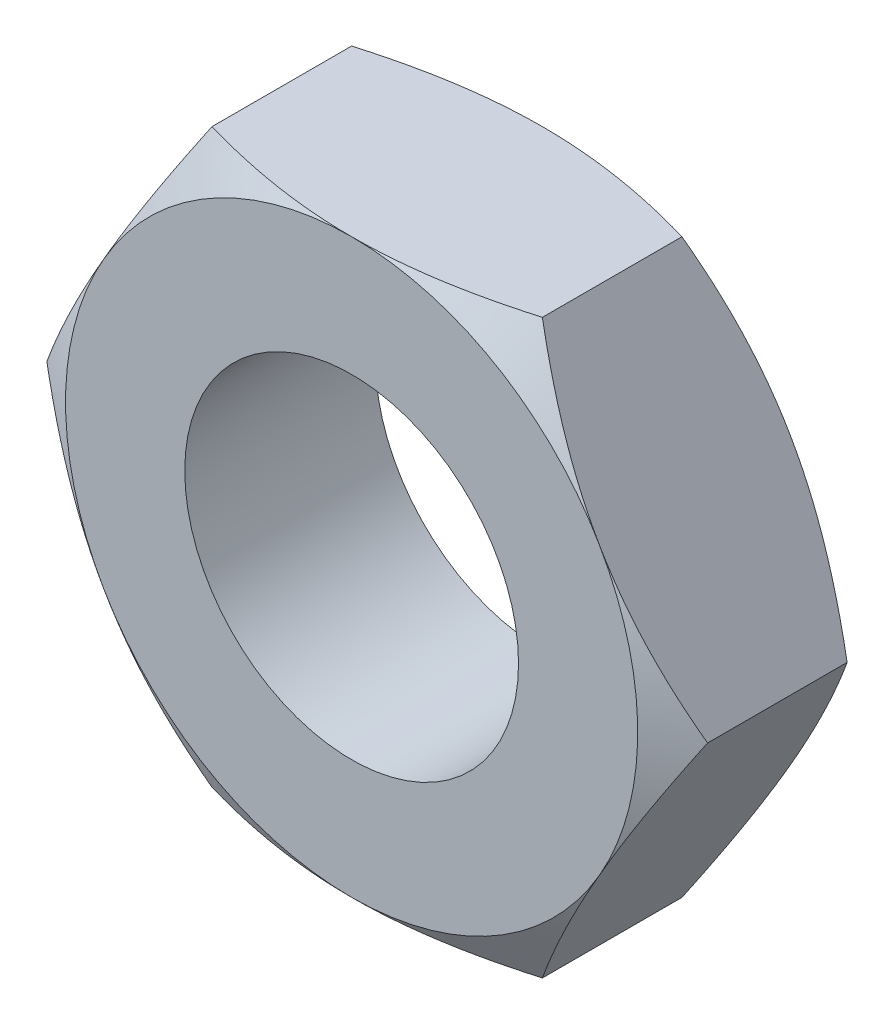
ISO-10303-21;
HEADER;
FILE_DESCRIPTION(('STEP AP214'),'2;1');
FILE_NAME('part.step','',(''),(''),'','','');
FILE_SCHEMA(('AUTOMOTIVE_DESIGN { 1 0 10303 214 1 1 1 1 }'));
ENDSEC;
DATA;
#1=APPLICATION_CONTEXT('core data for automotive mechanical design processes');
#2=APPLICATION_PROTOCOL_DEFINITION('international standard','automotive_design',2000,#1);
#3=PRODUCT_CONTEXT('',#1,'mechanical');
#4=PRODUCT('Part','Part','',(#3));
#5=PRODUCT_RELATED_PRODUCT_CATEGORY('part','',(#4));
#6=PRODUCT_DEFINITION_FORMATION('','',#4);
#7=PRODUCT_DEFINITION_CONTEXT('part definition',#1,'design');
#8=PRODUCT_DEFINITION('design','',#6,#7);
#9=PRODUCT_DEFINITION_SHAPE('','',#8);
#10=(LENGTH_UNIT() NAMED_UNIT(*) SI_UNIT(.MILLI.,.METRE.));
#11=(NAMED_UNIT(*) PLANE_ANGLE_UNIT() SI_UNIT($,.RADIAN.));
#12=(NAMED_UNIT(*) SI_UNIT($,.STERADIAN.) SOLID_ANGLE_UNIT());
#13=UNCERTAINTY_MEASURE_WITH_UNIT(LENGTH_MEASURE(1.E-05),#10,'distance_accuracy_value','');
#14=(GEOMETRIC_REPRESENTATION_CONTEXT(3) GLOBAL_UNCERTAINTY_ASSIGNED_CONTEXT((#13)) GLOBAL_UNIT_ASSIGNED_CONTEXT((#10,
#11,#12)) REPRESENTATION_CONTEXT('',''));
#15=CARTESIAN_POINT('',(0.,0.,0.));
#16=DIRECTION('',(0.,0.,1.));
#17=DIRECTION('',(1.,0.,0.));
#18=AXIS2_PLACEMENT_3D('',#15,#16,#17);
#19=CARTESIAN_POINT('',(-8.66025403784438,-15.,10.));
#20=DIRECTION('',(0.,1.,0.));
#21=DIRECTION('',(0.,0.,1.));
#22=AXIS2_PLACEMENT_3D('',#19,#20,#21);
#23=PLANE('',#22);
#24=DIRECTION('',(0.,0.,-1.));
#25=VECTOR('',#24,1.);
#26=CARTESIAN_POINT('',(-8.66025403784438,-15.,10.));
#27=LINE('',#26,#25);
#28=CARTESIAN_POINT('',(-8.66025403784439,-15.,8.66025403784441));
#29=VERTEX_POINT('',#28);
#30=CARTESIAN_POINT('',(-8.66025403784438,-15.,1.33974596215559));
#31=VERTEX_POINT('',#30);
#32=EDGE_CURVE('E257',#29,#31,#27,.T.);
#33=ORIENTED_EDGE('',*,*,#32,.T.);
#34=CARTESIAN_POINT('',(-22.9682699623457,-15.,7.17790057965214));
#35=CARTESIAN_POINT('',(-22.6389897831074,-15.,7.0187314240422));
#36=CARTESIAN_POINT('',(-22.3093116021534,-15.,6.86038603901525));
#37=CARTESIAN_POINT('',(-21.6490751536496,-15.,6.54553189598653));
#38=CARTESIAN_POINT('',(-21.3185168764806,-15.,6.38902315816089));
#39=CARTESIAN_POINT('',(-20.3252989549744,-15.,5.92249019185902));
#40=CARTESIAN_POINT('',(-19.6612032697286,-15.,5.6155111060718));
#41=CARTESIAN_POINT('',(-18.3246226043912,-15.,5.00989859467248));
#42=CARTESIAN_POINT('',(-17.6521113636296,-15.,4.71132298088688));
#43=CARTESIAN_POINT('',(-16.3015621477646,-15.,4.12699119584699));
#44=CARTESIAN_POINT('',(-15.6235244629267,-15.,3.84123435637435));
#45=CARTESIAN_POINT('',(-14.2524269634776,-15.,3.28256457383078));
#46=CARTESIAN_POINT('',(-13.5592849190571,-15.,3.00985238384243));
#47=CARTESIAN_POINT('',(-12.1648203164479,-15.,2.48578579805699));
#48=CARTESIAN_POINT('',(-11.4634968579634,-15.,2.23443377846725));
#49=CARTESIAN_POINT('',(-10.0530172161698,-15.,1.75984469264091));
#50=CARTESIAN_POINT('',(-9.34388131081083,-15.,1.53654785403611));
#51=CARTESIAN_POINT('',(-7.91545988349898,-15.,1.12531011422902));
#52=CARTESIAN_POINT('',(-7.19617764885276,-15.,0.937358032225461));
#53=CARTESIAN_POINT('',(-6.10950776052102,-15.,0.688818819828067));
#54=CARTESIAN_POINT('',(-5.74591626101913,-15.,0.61152452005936));
#55=CARTESIAN_POINT('',(-5.01631310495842,-15.,0.469286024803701));
#56=CARTESIAN_POINT('',(-4.65030150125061,-15.,0.404341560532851));
#57=CARTESIAN_POINT('',(-3.91609659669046,-15.,0.287952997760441));
#58=CARTESIAN_POINT('',(-3.5479031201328,-15.,0.236510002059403));
#59=CARTESIAN_POINT('',(-2.80977894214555,-15.,0.148161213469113));
#60=CARTESIAN_POINT('',(-2.43984831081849,-15.,0.111254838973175));
#61=CARTESIAN_POINT('',(-1.70111543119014,-15.,0.05296923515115));
#62=CARTESIAN_POINT('',(-1.3323208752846,-15.,0.0314931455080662));
#63=CARTESIAN_POINT('',(-0.59415403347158,-15.,0.00418216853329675));
#64=CARTESIAN_POINT('',(-0.224781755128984,-15.,-0.0016529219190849));
#65=CARTESIAN_POINT('',(0.513772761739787,-15.,0.00245653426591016));
#66=CARTESIAN_POINT('',(0.882955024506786,-15.,0.0123966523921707));
#67=CARTESIAN_POINT('',(1.62057875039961,-15.,0.047809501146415));
#68=CARTESIAN_POINT('',(1.98902017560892,-15.,0.0732830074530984));
#69=CARTESIAN_POINT('',(2.88200878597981,-15.,0.153315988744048));
#70=CARTESIAN_POINT('',(3.40586988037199,-15.,0.215658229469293));
#71=CARTESIAN_POINT('',(4.44957771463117,-15.,0.368284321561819));
#72=CARTESIAN_POINT('',(4.96942331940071,-15.,0.458575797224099));
#73=CARTESIAN_POINT('',(6.00467140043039,-15.,0.663898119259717));
#74=CARTESIAN_POINT('',(6.52006919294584,-15.,0.778952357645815));
#75=CARTESIAN_POINT('',(7.54556200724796,-15.,1.03028935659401));
#76=CARTESIAN_POINT('',(8.05565752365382,-15.,1.16657011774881));
#77=CARTESIAN_POINT('',(9.08310964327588,-15.,1.46066370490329));
#78=CARTESIAN_POINT('',(9.60033774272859,-15.,1.61892244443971));
#79=CARTESIAN_POINT('',(10.6293258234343,-15.,1.95107200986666));
#80=CARTESIAN_POINT('',(11.1410893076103,-15.,2.12495205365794));
#81=CARTESIAN_POINT('',(12.157099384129,-15.,2.48477464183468));
#82=CARTESIAN_POINT('',(12.6613720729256,-15.,2.67064378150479));
#83=CARTESIAN_POINT('',(13.4147912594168,-15.,2.95756327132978));
#84=CARTESIAN_POINT('',(13.6654863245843,-15.,3.05457748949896));
#85=CARTESIAN_POINT('',(14.1659013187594,-15.,3.25107322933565));
#86=CARTESIAN_POINT('',(14.4156212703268,-15.,3.35055469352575));
#87=CARTESIAN_POINT('',(14.6648887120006,-15.,3.45115877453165));
#88=B_SPLINE_CURVE_WITH_KNOTS('',3,(#34,#35,#36,#37,#38,#39,#40,#41,#42,#43,#44,#45,#46,#47,#48,
#49,#50,#51,#52,#53,#54,#55,#56,#57,#58,#59,#60,#61,#62,#63,#64,#65,#66,#67,#68,#69,#70,#71,#72,
#73,#74,#75,#76,#77,#78,#79,#80,#81,#82,#83,#84,#85,#86,#87),.UNSPECIFIED.,.F.,.F.,(4,2,2,2,2,2,
2,2,2,2,2,2,2,2,2,2,2,2,2,2,2,2,2,2,2,2,4),(0.,1.09719534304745,2.19440272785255,
4.38917437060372,6.59650580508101,8.80372204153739,11.0380360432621,13.2725982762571,
15.5023159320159,17.7313270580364,18.8463006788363,19.9612500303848,21.0762904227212,
22.1912861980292,23.2992201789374,24.407139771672,25.5147483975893,26.6224123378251,
28.2042036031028,29.7864267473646,31.3701511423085,32.9537264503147,34.5761185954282,
36.1973994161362,37.8095545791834,38.6159794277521,39.4223855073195),.UNSPECIFIED.);
#89=CARTESIAN_POINT('',(0.,-15.,0.));
#90=VERTEX_POINT('',#89);
#91=EDGE_CURVE('E60',#31,#90,#88,.T.);
#92=ORIENTED_EDGE('',*,*,#91,.T.);
#93=CARTESIAN_POINT('',(8.66025403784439,-15.,1.33974596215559));
#94=VERTEX_POINT('',#93);
#95=EDGE_CURVE('E213',#90,#94,#88,.T.);
#96=ORIENTED_EDGE('',*,*,#95,.T.);
#97=DIRECTION('',(0.,0.,-1.));
#98=VECTOR('',#97,1.);
#99=CARTESIAN_POINT('',(8.66025403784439,-15.,10.));
#100=LINE('',#99,#98);
#101=CARTESIAN_POINT('',(8.66025403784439,-15.,8.66025403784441));
#102=VERTEX_POINT('',#101);
#103=EDGE_CURVE('E274',#102,#94,#100,.T.);
#104=ORIENTED_EDGE('',*,*,#103,.F.);
#105=CARTESIAN_POINT('',(-22.9682699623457,-15.,2.82209942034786));
#106=CARTESIAN_POINT('',(-22.6389897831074,-15.,2.9812685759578));
#107=CARTESIAN_POINT('',(-22.3093116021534,-15.,3.13961396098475));
#108=CARTESIAN_POINT('',(-21.6490751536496,-15.,3.45446810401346));
#109=CARTESIAN_POINT('',(-21.3185168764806,-15.,3.61097684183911));
#110=CARTESIAN_POINT('',(-20.3252989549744,-15.,4.07750980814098));
#111=CARTESIAN_POINT('',(-19.6612032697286,-15.,4.3844888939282));
#112=CARTESIAN_POINT('',(-18.3246226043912,-15.,4.99010140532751));
#113=CARTESIAN_POINT('',(-17.6521113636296,-15.,5.28867701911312));
#114=CARTESIAN_POINT('',(-16.3015621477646,-15.,5.87300880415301));
#115=CARTESIAN_POINT('',(-15.6235244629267,-15.,6.15876564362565));
#116=CARTESIAN_POINT('',(-14.2524269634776,-15.,6.71743542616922));
#117=CARTESIAN_POINT('',(-13.5592849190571,-15.,6.99014761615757));
#118=CARTESIAN_POINT('',(-12.1648203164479,-15.,7.51421420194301));
#119=CARTESIAN_POINT('',(-11.4634968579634,-15.,7.76556622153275));
#120=CARTESIAN_POINT('',(-10.0530172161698,-15.,8.24015530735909));
#121=CARTESIAN_POINT('',(-9.34388131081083,-15.,8.46345214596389));
#122=CARTESIAN_POINT('',(-7.91545988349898,-15.,8.87468988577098));
#123=CARTESIAN_POINT('',(-7.19617764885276,-15.,9.06264196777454));
#124=CARTESIAN_POINT('',(-6.10950776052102,-15.,9.31118118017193));
#125=CARTESIAN_POINT('',(-5.74591626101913,-15.,9.38847547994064));
#126=CARTESIAN_POINT('',(-5.01631310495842,-15.,9.5307139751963));
#127=CARTESIAN_POINT('',(-4.65030150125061,-15.,9.59565843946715));
#128=CARTESIAN_POINT('',(-3.91609659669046,-15.,9.71204700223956));
#129=CARTESIAN_POINT('',(-3.5479031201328,-15.,9.7634899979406));
#130=CARTESIAN_POINT('',(-2.80977894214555,-15.,9.85183878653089));
#131=CARTESIAN_POINT('',(-2.43984831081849,-15.,9.88874516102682));
#132=CARTESIAN_POINT('',(-1.70111543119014,-15.,9.94703076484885));
#133=CARTESIAN_POINT('',(-1.3323208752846,-15.,9.96850685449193));
#134=CARTESIAN_POINT('',(-0.594154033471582,-15.,9.9958178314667));
#135=CARTESIAN_POINT('',(-0.224781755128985,-15.,10.0016529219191));
#136=CARTESIAN_POINT('',(0.513772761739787,-15.,9.99754346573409));
#137=CARTESIAN_POINT('',(0.882955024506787,-15.,9.98760334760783));
#138=CARTESIAN_POINT('',(1.62057875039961,-15.,9.95219049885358));
#139=CARTESIAN_POINT('',(1.98902017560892,-15.,9.9267169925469));
#140=CARTESIAN_POINT('',(2.88200878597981,-15.,9.84668401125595));
#141=CARTESIAN_POINT('',(3.40586988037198,-15.,9.78434177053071));
#142=CARTESIAN_POINT('',(4.44957771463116,-15.,9.63171567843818));
#143=CARTESIAN_POINT('',(4.9694233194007,-15.,9.5414242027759));
#144=CARTESIAN_POINT('',(6.00467140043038,-15.,9.33610188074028));
#145=CARTESIAN_POINT('',(6.52006919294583,-15.,9.22104764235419));
#146=CARTESIAN_POINT('',(7.54556200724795,-15.,8.96971064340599));
#147=CARTESIAN_POINT('',(8.05565752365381,-15.,8.83342988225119));
#148=CARTESIAN_POINT('',(9.08310964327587,-15.,8.53933629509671));
#149=CARTESIAN_POINT('',(9.60033774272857,-15.,8.3810775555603));
#150=CARTESIAN_POINT('',(10.6293258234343,-15.,8.04892799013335));
#151=CARTESIAN_POINT('',(11.1410893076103,-15.,7.87504794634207));
#152=CARTESIAN_POINT('',(12.157099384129,-15.,7.51522535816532));
#153=CARTESIAN_POINT('',(12.6613720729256,-15.,7.32935621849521));
#154=CARTESIAN_POINT('',(13.4147912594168,-15.,7.04243672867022));
#155=CARTESIAN_POINT('',(13.6654863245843,-15.,6.94542251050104));
#156=CARTESIAN_POINT('',(14.1659013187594,-15.,6.74892677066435));
#157=CARTESIAN_POINT('',(14.4156212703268,-15.,6.64944530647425));
#158=CARTESIAN_POINT('',(14.6648887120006,-15.,6.54884122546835));
#159=B_SPLINE_CURVE_WITH_KNOTS('',3,(#105,#106,#107,#108,#109,#110,#111,#112,#113,#114,#115,
#116,#117,#118,#119,#120,#121,#122,#123,#124,#125,#126,#127,#128,#129,#130,#131,#132,#133,#134,
#135,#136,#137,#138,#139,#140,#141,#142,#143,#144,#145,#146,#147,#148,#149,#150,#151,#152,#153,
#154,#155,#156,#157,#158),.UNSPECIFIED.,.F.,.F.,(4,2,2,2,2,2,2,2,2,2,2,2,2,2,2,2,2,2,2,2,2,2,2,
2,2,2,4),(0.,1.09719534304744,2.19440272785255,4.38917437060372,6.596505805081,8.80372204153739,
11.0380360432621,13.2725982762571,15.5023159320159,17.7313270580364,18.8463006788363,
19.9612500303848,21.0762904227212,22.1912861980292,23.2992201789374,24.407139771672,
25.5147483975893,26.6224123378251,28.2042036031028,29.7864267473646,31.3701511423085,
32.9537264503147,34.5761185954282,36.1973994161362,37.8095545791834,38.6159794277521,
39.4223855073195),.UNSPECIFIED.);
#160=CARTESIAN_POINT('',(0.,-15.,10.));
#161=VERTEX_POINT('',#160);
#162=EDGE_CURVE('E328',#102,#161,#159,.F.);
#163=ORIENTED_EDGE('',*,*,#162,.T.);
#164=EDGE_CURVE('E321',#161,#29,#159,.F.);
#165=ORIENTED_EDGE('',*,*,#164,.T.);
#166=EDGE_LOOP('',(#33,#92,#96,#104,#163,#165));
#167=FACE_BOUND('',#166,.T.);
#168=ADVANCED_FACE('F37',(#167),#23,.F.);
#169=CARTESIAN_POINT('',(8.66025403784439,-15.,10.));
#170=DIRECTION('',(-0.866025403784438,0.5,0.));
#171=DIRECTION('',(-0.5,-0.866025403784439,0.));
#172=AXIS2_PLACEMENT_3D('',#169,#170,#171);
#173=PLANE('',#172);
#174=ORIENTED_EDGE('',*,*,#103,.T.);
#175=CARTESIAN_POINT('',(8.66013856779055,-15.0002,1.33981262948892));
#176=CARTESIAN_POINT('',(8.85048754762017,-14.6705058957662,1.22992178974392));
#177=CARTESIAN_POINT('',(9.04157899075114,-14.3395258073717,1.1250175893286));
#178=CARTESIAN_POINT('',(9.42529420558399,-13.674911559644,0.926568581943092));
#179=CARTESIAN_POINT('',(9.61791845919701,-13.3412765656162,0.833027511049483));
#180=CARTESIAN_POINT('',(10.0050715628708,-12.6707077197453,0.658562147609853));
#181=CARTESIAN_POINT('',(10.199603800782,-12.333767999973,0.577667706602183));
#182=CARTESIAN_POINT('',(10.5900200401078,-11.6575472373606,0.430232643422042));
#183=CARTESIAN_POINT('',(10.7859039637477,-11.3182663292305,0.363691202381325));
#184=CARTESIAN_POINT('',(11.1740042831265,-10.6460568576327,0.247792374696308));
#185=CARTESIAN_POINT('',(11.3661918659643,-10.3131781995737,0.198051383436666));
#186=CARTESIAN_POINT('',(11.7514476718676,-9.64589556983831,0.114646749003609));
#187=CARTESIAN_POINT('',(11.9445159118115,-9.31149156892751,0.0809834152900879));
#188=CARTESIAN_POINT('',(12.3309767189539,-8.64212181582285,0.0305840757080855));
#189=CARTESIAN_POINT('',(12.5243686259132,-8.30715720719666,0.013827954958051));
#190=CARTESIAN_POINT('',(12.9113309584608,-7.636918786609,-0.00239660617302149));
#191=CARTESIAN_POINT('',(13.1049013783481,-7.30164498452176,-0.0018655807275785));
#192=CARTESIAN_POINT('',(13.4667798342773,-6.6748531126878,0.0152766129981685));
#193=CARTESIAN_POINT('',(13.6351136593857,-6.38329037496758,0.0297968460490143));
#194=CARTESIAN_POINT('',(13.9713941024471,-5.80083556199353,0.0716371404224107));
#195=CARTESIAN_POINT('',(14.1393406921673,-5.50994353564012,0.0989581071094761));
#196=CARTESIAN_POINT('',(14.4747554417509,-4.92898814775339,0.165923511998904));
#197=CARTESIAN_POINT('',(14.6422230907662,-4.63892567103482,0.20557812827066));
#198=CARTESIAN_POINT('',(14.9763732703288,-4.06016058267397,0.296515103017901));
#199=CARTESIAN_POINT('',(15.1430557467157,-3.77145806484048,0.347798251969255));
#200=CARTESIAN_POINT('',(15.6490296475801,-2.8950855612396,0.520386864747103));
#201=CARTESIAN_POINT('',(15.9868558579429,-2.30995340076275,0.658901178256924));
#202=CARTESIAN_POINT('',(16.6574708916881,-1.14841408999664,0.973271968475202));
#203=CARTESIAN_POINT('',(16.9902683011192,-0.57199206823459,1.14905461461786));
#204=CARTESIAN_POINT('',(17.3206235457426,0.000199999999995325,1.33981262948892));
#205=B_SPLINE_CURVE_WITH_KNOTS('',3,(#175,#176,#177,#178,#179,#180,#181,#182,#183,#184,#185,
#186,#187,#188,#189,#190,#191,#192,#193,#194,#195,#196,#197,#198,#199,#200,#201,#202,#203,#204),
.UNSPECIFIED.,.F.,.F.,(4,2,2,2,2,2,2,2,2,2,2,2,2,2,4),(0.,1.18875411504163,2.37789802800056,
3.56980778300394,4.76164951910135,5.92407379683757,7.0865204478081,8.24758247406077,
9.40860862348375,10.4193068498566,11.4300765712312,12.4416826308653,13.4533574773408,
15.5211962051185,17.5849760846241),.UNSPECIFIED.);
#206=CARTESIAN_POINT('',(12.9903810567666,-7.5,0.));
#207=VERTEX_POINT('',#206);
#208=EDGE_CURVE('E211',#94,#207,#205,.T.);
#209=ORIENTED_EDGE('',*,*,#208,.T.);
#210=CARTESIAN_POINT('',(17.3205080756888,0.,1.33974596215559));
#211=VERTEX_POINT('',#210);
#212=EDGE_CURVE('E205',#207,#211,#205,.T.);
#213=ORIENTED_EDGE('',*,*,#212,.T.);
#214=DIRECTION('',(0.,0.,-1.));
#215=VECTOR('',#214,1.);
#216=CARTESIAN_POINT('',(17.3205080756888,0.,10.));
#217=LINE('',#216,#215);
#218=CARTESIAN_POINT('',(17.3205080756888,0.,8.66025403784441));
#219=VERTEX_POINT('',#218);
#220=EDGE_CURVE('E270',#219,#211,#217,.T.);
#221=ORIENTED_EDGE('',*,*,#220,.F.);
#222=CARTESIAN_POINT('',(17.3206235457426,0.000199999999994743,8.66018737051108));
#223=CARTESIAN_POINT('',(17.130274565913,-0.329494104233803,8.77007821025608));
#224=CARTESIAN_POINT('',(16.939183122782,-0.660474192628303,8.8749824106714));
#225=CARTESIAN_POINT('',(16.5554679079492,-1.32508844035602,9.07343141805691));
#226=CARTESIAN_POINT('',(16.3628436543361,-1.6587234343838,9.16697248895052));
#227=CARTESIAN_POINT('',(15.9756905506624,-2.32929228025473,9.34143785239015));
#228=CARTESIAN_POINT('',(15.7811583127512,-2.66623200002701,9.42233229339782));
#229=CARTESIAN_POINT('',(15.3907420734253,-3.34245276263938,9.56976735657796));
#230=CARTESIAN_POINT('',(15.1948581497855,-3.68173367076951,9.63630879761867));
#231=CARTESIAN_POINT('',(14.8067578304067,-4.35394314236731,9.75220762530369));
#232=CARTESIAN_POINT('',(14.6145702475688,-4.68682180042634,9.80194861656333));
#233=CARTESIAN_POINT('',(14.2293144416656,-5.35410443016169,9.88535325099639));
#234=CARTESIAN_POINT('',(14.0362462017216,-5.68850843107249,9.91901658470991));
#235=CARTESIAN_POINT('',(13.6497853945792,-6.35787818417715,9.96941592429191));
#236=CARTESIAN_POINT('',(13.4563934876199,-6.69284279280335,9.98617204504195));
#237=CARTESIAN_POINT('',(13.0694311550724,-7.363081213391,10.002396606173));
#238=CARTESIAN_POINT('',(12.8758607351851,-7.69835501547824,10.0018655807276));
#239=CARTESIAN_POINT('',(12.5139822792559,-8.3251468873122,9.98472338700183));
#240=CARTESIAN_POINT('',(12.3456484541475,-8.61670962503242,9.97020315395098));
#241=CARTESIAN_POINT('',(12.0093680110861,-9.19916443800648,9.92836285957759));
#242=CARTESIAN_POINT('',(11.8414214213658,-9.49005646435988,9.90104189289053));
#243=CARTESIAN_POINT('',(11.5060066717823,-10.0710118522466,9.8340764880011));
#244=CARTESIAN_POINT('',(11.338539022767,-10.3610743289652,9.79442187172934));
#245=CARTESIAN_POINT('',(11.0043888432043,-10.939839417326,9.7034848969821));
#246=CARTESIAN_POINT('',(10.8377063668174,-11.2285419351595,9.65220174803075));
#247=CARTESIAN_POINT('',(10.3317324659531,-12.1049144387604,9.4796131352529));
#248=CARTESIAN_POINT('',(9.99390625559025,-12.6900465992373,9.34109882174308));
#249=CARTESIAN_POINT('',(9.32329122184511,-13.8515859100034,9.0267280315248));
#250=CARTESIAN_POINT('',(8.99049381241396,-14.4280079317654,8.85094538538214));
#251=CARTESIAN_POINT('',(8.66013856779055,-15.0002,8.66018737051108));
#252=B_SPLINE_CURVE_WITH_KNOTS('',3,(#222,#223,#224,#225,#226,#227,#228,#229,#230,#231,#232,
#233,#234,#235,#236,#237,#238,#239,#240,#241,#242,#243,#244,#245,#246,#247,#248,#249,#250,#251),
.UNSPECIFIED.,.F.,.F.,(4,2,2,2,2,2,2,2,2,2,2,2,2,2,4),(0.,1.18875411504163,2.37789802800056,
3.56980778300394,4.76164951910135,5.92407379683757,7.0865204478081,8.24758247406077,
9.40860862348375,10.4193068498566,11.4300765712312,12.4416826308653,13.4533574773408,
15.5211962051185,17.5849760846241),.UNSPECIFIED.);
#253=CARTESIAN_POINT('',(12.9903810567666,-7.5,10.));
#254=VERTEX_POINT('',#253);
#255=EDGE_CURVE('E234',#219,#254,#252,.T.);
#256=ORIENTED_EDGE('',*,*,#255,.T.);
#257=EDGE_CURVE('E226',#254,#102,#252,.T.);
#258=ORIENTED_EDGE('',*,*,#257,.T.);
#259=EDGE_LOOP('',(#174,#209,#213,#221,#256,#258));
#260=FACE_BOUND('',#259,.T.);
#261=ADVANCED_FACE('F218',(#260),#173,.F.);
#262=CARTESIAN_POINT('',(17.3205080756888,0.,10.));
#263=DIRECTION('',(-0.866025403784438,-0.5,0.));
#264=DIRECTION('',(0.5,-0.866025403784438,0.));
#265=AXIS2_PLACEMENT_3D('',#262,#263,#264);
#266=PLANE('',#265);
#267=ORIENTED_EDGE('',*,*,#220,.T.);
#268=CARTESIAN_POINT('',(17.3206235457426,-0.000200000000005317,1.33981262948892));
#269=CARTESIAN_POINT('',(17.130274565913,0.329494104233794,1.22992178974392));
#270=CARTESIAN_POINT('',(16.939183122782,0.660474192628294,1.1250175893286));
#271=CARTESIAN_POINT('',(16.5554679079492,1.32508844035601,0.926568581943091));
#272=CARTESIAN_POINT('',(16.3628436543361,1.65872343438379,0.833027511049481));
#273=CARTESIAN_POINT('',(15.9756905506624,2.32929228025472,0.658562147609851));
#274=CARTESIAN_POINT('',(15.7811583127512,2.666232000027,0.577667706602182));
#275=CARTESIAN_POINT('',(15.3907420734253,3.34245276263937,0.43023264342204));
#276=CARTESIAN_POINT('',(15.1948581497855,3.6817336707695,0.363691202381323));
#277=CARTESIAN_POINT('',(14.8067578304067,4.3539431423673,0.247792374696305));
#278=CARTESIAN_POINT('',(14.6145702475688,4.68682180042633,0.198051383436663));
#279=CARTESIAN_POINT('',(14.2293144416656,5.35410443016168,0.114646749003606));
#280=CARTESIAN_POINT('',(14.0362462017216,5.68850843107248,0.0809834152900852));
#281=CARTESIAN_POINT('',(13.6497853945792,6.35787818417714,0.0305840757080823));
#282=CARTESIAN_POINT('',(13.4563934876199,6.69284279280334,0.0138279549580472));
#283=CARTESIAN_POINT('',(13.0694311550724,7.36308121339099,-0.0023966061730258));
#284=CARTESIAN_POINT('',(12.8758607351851,7.69835501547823,-0.00186558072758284));
#285=CARTESIAN_POINT('',(12.5139822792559,8.32514688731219,0.0152766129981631));
#286=CARTESIAN_POINT('',(12.3456484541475,8.61670962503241,0.0297968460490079));
#287=CARTESIAN_POINT('',(12.0093680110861,9.19916443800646,0.0716371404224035));
#288=CARTESIAN_POINT('',(11.8414214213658,9.49005646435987,0.0989581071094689));
#289=CARTESIAN_POINT('',(11.5060066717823,10.0710118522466,0.165923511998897));
#290=CARTESIAN_POINT('',(11.338539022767,10.3610743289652,0.205578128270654));
#291=CARTESIAN_POINT('',(11.0043888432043,10.939839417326,0.296515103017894));
#292=CARTESIAN_POINT('',(10.8377063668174,11.2285419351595,0.347798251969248));
#293=CARTESIAN_POINT('',(10.3317324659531,12.1049144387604,0.520386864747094));
#294=CARTESIAN_POINT('',(9.99390625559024,12.6900465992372,0.658901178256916));
#295=CARTESIAN_POINT('',(9.32329122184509,13.8515859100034,0.973271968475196));
#296=CARTESIAN_POINT('',(8.99049381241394,14.4280079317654,1.14905461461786));
#297=CARTESIAN_POINT('',(8.66013856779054,15.0002,1.33981262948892));
#298=B_SPLINE_CURVE_WITH_KNOTS('',3,(#268,#269,#270,#271,#272,#273,#274,#275,#276,#277,#278,
#279,#280,#281,#282,#283,#284,#285,#286,#287,#288,#289,#290,#291,#292,#293,#294,#295,#296,#297),
.UNSPECIFIED.,.F.,.F.,(4,2,2,2,2,2,2,2,2,2,2,2,2,2,4),(0.,1.18875411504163,2.37789802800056,
3.56980778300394,4.76164951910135,5.92407379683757,7.0865204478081,8.24758247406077,
9.40860862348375,10.4193068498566,11.4300765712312,12.4416826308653,13.4533574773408,
15.5211962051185,17.5849760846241),.UNSPECIFIED.);
#299=CARTESIAN_POINT('',(12.9903810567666,7.50000000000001,0.));
#300=VERTEX_POINT('',#299);
#301=EDGE_CURVE('E212',#211,#300,#298,.T.);
#302=ORIENTED_EDGE('',*,*,#301,.T.);
#303=CARTESIAN_POINT('',(8.66025403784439,15.,1.33974596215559));
#304=VERTEX_POINT('',#303);
#305=EDGE_CURVE('E199',#300,#304,#298,.T.);
#306=ORIENTED_EDGE('',*,*,#305,.T.);
#307=DIRECTION('',(0.,0.,-1.));
#308=VECTOR('',#307,1.);
#309=CARTESIAN_POINT('',(8.66025403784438,15.,10.));
#310=LINE('',#309,#308);
#311=CARTESIAN_POINT('',(8.66025403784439,15.,8.66025403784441));
#312=VERTEX_POINT('',#311);
#313=EDGE_CURVE('E266',#312,#304,#310,.T.);
#314=ORIENTED_EDGE('',*,*,#313,.F.);
#315=CARTESIAN_POINT('',(8.66013856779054,15.0002,8.66018737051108));
#316=CARTESIAN_POINT('',(8.85048754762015,14.6705058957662,8.77007821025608));
#317=CARTESIAN_POINT('',(9.04157899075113,14.3395258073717,8.87498241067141));
#318=CARTESIAN_POINT('',(9.42529420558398,13.674911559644,9.07343141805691));
#319=CARTESIAN_POINT('',(9.617918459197,13.3412765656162,9.16697248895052));
#320=CARTESIAN_POINT('',(10.0050715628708,12.6707077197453,9.34143785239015));
#321=CARTESIAN_POINT('',(10.199603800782,12.333767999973,9.42233229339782));
#322=CARTESIAN_POINT('',(10.5900200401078,11.6575472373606,9.56976735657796));
#323=CARTESIAN_POINT('',(10.7859039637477,11.3182663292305,9.63630879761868));
#324=CARTESIAN_POINT('',(11.1740042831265,10.6460568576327,9.7522076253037));
#325=CARTESIAN_POINT('',(11.3661918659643,10.3131781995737,9.80194861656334));
#326=CARTESIAN_POINT('',(11.7514476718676,9.64589556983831,9.8853532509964));
#327=CARTESIAN_POINT('',(11.9445159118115,9.31149156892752,9.91901658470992));
#328=CARTESIAN_POINT('',(12.3309767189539,8.64212181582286,9.96941592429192));
#329=CARTESIAN_POINT('',(12.5243686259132,8.30715720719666,9.98617204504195));
#330=CARTESIAN_POINT('',(12.9113309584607,7.63691878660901,10.002396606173));
#331=CARTESIAN_POINT('',(13.104901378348,7.30164498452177,10.0018655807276));
#332=CARTESIAN_POINT('',(13.4667798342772,6.67485311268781,9.98472338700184));
#333=CARTESIAN_POINT('',(13.6351136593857,6.38329037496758,9.97020315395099));
#334=CARTESIAN_POINT('',(13.971394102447,5.80083556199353,9.9283628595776));
#335=CARTESIAN_POINT('',(14.1393406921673,5.50994353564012,9.90104189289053));
#336=CARTESIAN_POINT('',(14.4747554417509,4.92898814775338,9.8340764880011));
#337=CARTESIAN_POINT('',(14.6422230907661,4.63892567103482,9.79442187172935));
#338=CARTESIAN_POINT('',(14.9763732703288,4.06016058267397,9.7034848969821));
#339=CARTESIAN_POINT('',(15.1430557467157,3.77145806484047,9.65220174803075));
#340=CARTESIAN_POINT('',(15.6490296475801,2.8950855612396,9.4796131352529));
#341=CARTESIAN_POINT('',(15.9868558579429,2.30995340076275,9.34109882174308));
#342=CARTESIAN_POINT('',(16.6574708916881,1.14841408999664,9.0267280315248));
#343=CARTESIAN_POINT('',(16.9902683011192,0.571992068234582,8.85094538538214));
#344=CARTESIAN_POINT('',(17.3206235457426,-0.000200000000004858,8.66018737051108));
#345=B_SPLINE_CURVE_WITH_KNOTS('',3,(#315,#316,#317,#318,#319,#320,#321,#322,#323,#324,#325,
#326,#327,#328,#329,#330,#331,#332,#333,#334,#335,#336,#337,#338,#339,#340,#341,#342,#343,#344),
.UNSPECIFIED.,.F.,.F.,(4,2,2,2,2,2,2,2,2,2,2,2,2,2,4),(0.,1.18875411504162,2.37789802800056,
3.56980778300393,4.76164951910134,5.92407379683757,7.0865204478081,8.24758247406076,
9.40860862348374,10.4193068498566,11.4300765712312,12.4416826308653,13.4533574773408,
15.5211962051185,17.5849760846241),.UNSPECIFIED.);
#346=CARTESIAN_POINT('',(12.9903810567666,7.50000000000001,10.));
#347=VERTEX_POINT('',#346);
#348=EDGE_CURVE('E247',#312,#347,#345,.T.);
#349=ORIENTED_EDGE('',*,*,#348,.T.);
#350=EDGE_CURVE('E240',#347,#219,#345,.T.);
#351=ORIENTED_EDGE('',*,*,#350,.T.);
#352=EDGE_LOOP('',(#267,#302,#306,#314,#349,#351));
#353=FACE_BOUND('',#352,.T.);
#354=ADVANCED_FACE('F221',(#353),#266,.F.);
#355=CARTESIAN_POINT('',(8.66025403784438,15.,10.));
#356=DIRECTION('',(0.,-1.,0.));
#357=DIRECTION('',(0.,0.,-1.));
#358=AXIS2_PLACEMENT_3D('',#355,#356,#357);
#359=PLANE('',#358);
#360=ORIENTED_EDGE('',*,*,#313,.T.);
#361=CARTESIAN_POINT('',(-22.9682699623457,15.,7.17790057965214));
#362=CARTESIAN_POINT('',(-22.6389897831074,15.,7.01873142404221));
#363=CARTESIAN_POINT('',(-22.3093116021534,15.,6.86038603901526));
#364=CARTESIAN_POINT('',(-21.6490751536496,15.,6.54553189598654));
#365=CARTESIAN_POINT('',(-21.3185168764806,15.,6.38902315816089));
#366=CARTESIAN_POINT('',(-20.3252989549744,15.,5.92249019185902));
#367=CARTESIAN_POINT('',(-19.6612032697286,15.,5.6155111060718));
#368=CARTESIAN_POINT('',(-18.3246226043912,15.,5.00989859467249));
#369=CARTESIAN_POINT('',(-17.6521113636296,15.,4.71132298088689));
#370=CARTESIAN_POINT('',(-16.3015621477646,15.,4.12699119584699));
#371=CARTESIAN_POINT('',(-15.6235244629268,15.,3.84123435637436));
#372=CARTESIAN_POINT('',(-14.2524269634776,15.,3.28256457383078));
#373=CARTESIAN_POINT('',(-13.5592849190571,15.,3.00985238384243));
#374=CARTESIAN_POINT('',(-12.1648203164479,15.,2.48578579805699));
#375=CARTESIAN_POINT('',(-11.4634968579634,15.,2.23443377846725));
#376=CARTESIAN_POINT('',(-10.0530172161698,15.,1.75984469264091));
#377=CARTESIAN_POINT('',(-9.34388131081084,15.,1.53654785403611));
#378=CARTESIAN_POINT('',(-7.91545988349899,15.,1.12531011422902));
#379=CARTESIAN_POINT('',(-7.19617764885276,15.,0.937358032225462));
#380=CARTESIAN_POINT('',(-6.10950776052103,15.,0.688818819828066));
#381=CARTESIAN_POINT('',(-5.74591626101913,15.,0.61152452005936));
#382=CARTESIAN_POINT('',(-5.01631310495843,15.,0.4692860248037));
#383=CARTESIAN_POINT('',(-4.65030150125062,15.,0.404341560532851));
#384=CARTESIAN_POINT('',(-3.91609659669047,15.,0.28795299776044));
#385=CARTESIAN_POINT('',(-3.54790312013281,15.,0.236510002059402));
#386=CARTESIAN_POINT('',(-2.80977894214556,15.,0.148161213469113));
#387=CARTESIAN_POINT('',(-2.43984831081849,15.,0.111254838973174));
#388=CARTESIAN_POINT('',(-1.70111543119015,15.,0.0529692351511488));
#389=CARTESIAN_POINT('',(-1.33232087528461,15.,0.0314931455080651));
#390=CARTESIAN_POINT('',(-0.594154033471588,15.,0.00418216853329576));
#391=CARTESIAN_POINT('',(-0.224781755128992,15.,-0.00165292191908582));
#392=CARTESIAN_POINT('',(0.513772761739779,15.,0.00245653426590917));
#393=CARTESIAN_POINT('',(0.882955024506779,15.,0.0123966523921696));
#394=CARTESIAN_POINT('',(1.6205787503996,15.,0.0478095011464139));
#395=CARTESIAN_POINT('',(1.98902017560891,15.,0.0732830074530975));
#396=CARTESIAN_POINT('',(2.8820087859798,15.,0.153315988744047));
#397=CARTESIAN_POINT('',(3.40586988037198,15.,0.21565822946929));
#398=CARTESIAN_POINT('',(4.44957771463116,15.,0.368284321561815));
#399=CARTESIAN_POINT('',(4.9694233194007,15.,0.458575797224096));
#400=CARTESIAN_POINT('',(6.00467140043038,15.,0.663898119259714));
#401=CARTESIAN_POINT('',(6.52006919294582,15.,0.778952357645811));
#402=CARTESIAN_POINT('',(7.54556200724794,15.,1.030289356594));
#403=CARTESIAN_POINT('',(8.0556575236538,15.,1.16657011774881));
#404=CARTESIAN_POINT('',(9.08310964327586,15.,1.46066370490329));
#405=CARTESIAN_POINT('',(9.60033774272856,15.,1.6189224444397));
#406=CARTESIAN_POINT('',(10.6293258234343,15.,1.95107200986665));
#407=CARTESIAN_POINT('',(11.1410893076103,15.,2.12495205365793));
#408=CARTESIAN_POINT('',(12.157099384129,15.,2.48477464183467));
#409=CARTESIAN_POINT('',(12.6613720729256,15.,2.67064378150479));
#410=CARTESIAN_POINT('',(13.4147912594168,15.,2.95756327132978));
#411=CARTESIAN_POINT('',(13.6654863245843,15.,3.05457748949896));
#412=CARTESIAN_POINT('',(14.1659013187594,15.,3.25107322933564));
#413=CARTESIAN_POINT('',(14.4156212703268,15.,3.35055469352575));
#414=CARTESIAN_POINT('',(14.6648887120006,15.,3.45115877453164));
#415=B_SPLINE_CURVE_WITH_KNOTS('',3,(#361,#362,#363,#364,#365,#366,#367,#368,#369,#370,#371,
#372,#373,#374,#375,#376,#377,#378,#379,#380,#381,#382,#383,#384,#385,#386,#387,#388,#389,#390,
#391,#392,#393,#394,#395,#396,#397,#398,#399,#400,#401,#402,#403,#404,#405,#406,#407,#408,#409,
#410,#411,#412,#413,#414),.UNSPECIFIED.,.F.,.F.,(4,2,2,2,2,2,2,2,2,2,2,2,2,2,2,2,2,2,2,2,2,2,2,
2,2,2,4),(0.,1.09719534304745,2.19440272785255,4.38917437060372,6.59650580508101,
8.8037220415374,11.0380360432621,13.2725982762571,15.5023159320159,17.7313270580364,
18.8463006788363,19.9612500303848,21.0762904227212,22.1912861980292,23.2992201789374,
24.407139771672,25.5147483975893,26.6224123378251,28.2042036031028,29.7864267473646,
31.3701511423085,32.9537264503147,34.5761185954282,36.1973994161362,37.8095545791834,
38.6159794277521,39.4223855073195),.UNSPECIFIED.);
#416=CARTESIAN_POINT('',(0.,15.,0.));
#417=VERTEX_POINT('',#416);
#418=EDGE_CURVE('E167',#304,#417,#415,.F.);
#419=ORIENTED_EDGE('',*,*,#418,.T.);
#420=CARTESIAN_POINT('',(-8.6602540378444,15.,1.33974596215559));
#421=VERTEX_POINT('',#420);
#422=EDGE_CURVE('E147',#417,#421,#415,.F.);
#423=ORIENTED_EDGE('',*,*,#422,.T.);
#424=DIRECTION('',(0.,0.,-1.));
#425=VECTOR('',#424,1.);
#426=CARTESIAN_POINT('',(-8.66025403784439,15.,10.));
#427=LINE('',#426,#425);
#428=CARTESIAN_POINT('',(-8.6602540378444,15.,8.66025403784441));
#429=VERTEX_POINT('',#428);
#430=EDGE_CURVE('E163',#429,#421,#427,.T.);
#431=ORIENTED_EDGE('',*,*,#430,.F.);
#432=CARTESIAN_POINT('',(-22.9682699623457,15.,2.82209942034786));
#433=CARTESIAN_POINT('',(-22.6389897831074,15.,2.98126857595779));
#434=CARTESIAN_POINT('',(-22.3093116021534,15.,3.13961396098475));
#435=CARTESIAN_POINT('',(-21.6490751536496,15.,3.45446810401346));
#436=CARTESIAN_POINT('',(-21.3185168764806,15.,3.61097684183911));
#437=CARTESIAN_POINT('',(-20.3252989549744,15.,4.07750980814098));
#438=CARTESIAN_POINT('',(-19.6612032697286,15.,4.38448889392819));
#439=CARTESIAN_POINT('',(-18.3246226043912,15.,4.99010140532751));
#440=CARTESIAN_POINT('',(-17.6521113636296,15.,5.28867701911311));
#441=CARTESIAN_POINT('',(-16.3015621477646,15.,5.87300880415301));
#442=CARTESIAN_POINT('',(-15.6235244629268,15.,6.15876564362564));
#443=CARTESIAN_POINT('',(-14.2524269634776,15.,6.71743542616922));
#444=CARTESIAN_POINT('',(-13.5592849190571,15.,6.99014761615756));
#445=CARTESIAN_POINT('',(-12.1648203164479,15.,7.51421420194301));
#446=CARTESIAN_POINT('',(-11.4634968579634,15.,7.76556622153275));
#447=CARTESIAN_POINT('',(-10.0530172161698,15.,8.24015530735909));
#448=CARTESIAN_POINT('',(-9.34388131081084,15.,8.46345214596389));
#449=CARTESIAN_POINT('',(-7.91545988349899,15.,8.87468988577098));
#450=CARTESIAN_POINT('',(-7.19617764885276,15.,9.06264196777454));
#451=CARTESIAN_POINT('',(-6.10950776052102,15.,9.31118118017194));
#452=CARTESIAN_POINT('',(-5.74591626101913,15.,9.38847547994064));
#453=CARTESIAN_POINT('',(-5.01631310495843,15.,9.5307139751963));
#454=CARTESIAN_POINT('',(-4.65030150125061,15.,9.59565843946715));
#455=CARTESIAN_POINT('',(-3.91609659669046,15.,9.71204700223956));
#456=CARTESIAN_POINT('',(-3.5479031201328,15.,9.7634899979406));
#457=CARTESIAN_POINT('',(-2.80977894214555,15.,9.85183878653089));
#458=CARTESIAN_POINT('',(-2.43984831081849,15.,9.88874516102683));
#459=CARTESIAN_POINT('',(-1.70111543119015,15.,9.94703076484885));
#460=CARTESIAN_POINT('',(-1.3323208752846,15.,9.96850685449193));
#461=CARTESIAN_POINT('',(-0.594154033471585,15.,9.9958178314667));
#462=CARTESIAN_POINT('',(-0.224781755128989,15.,10.0016529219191));
#463=CARTESIAN_POINT('',(0.513772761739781,15.,9.99754346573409));
#464=CARTESIAN_POINT('',(0.88295502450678,15.,9.98760334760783));
#465=CARTESIAN_POINT('',(1.6205787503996,15.,9.95219049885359));
#466=CARTESIAN_POINT('',(1.98902017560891,15.,9.9267169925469));
#467=CARTESIAN_POINT('',(2.8820087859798,15.,9.84668401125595));
#468=CARTESIAN_POINT('',(3.40586988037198,15.,9.78434177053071));
#469=CARTESIAN_POINT('',(4.44957771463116,15.,9.63171567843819));
#470=CARTESIAN_POINT('',(4.9694233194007,15.,9.5414242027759));
#471=CARTESIAN_POINT('',(6.00467140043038,15.,9.33610188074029));
#472=CARTESIAN_POINT('',(6.52006919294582,15.,9.22104764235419));
#473=CARTESIAN_POINT('',(7.54556200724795,15.,8.96971064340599));
#474=CARTESIAN_POINT('',(8.05565752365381,15.,8.83342988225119));
#475=CARTESIAN_POINT('',(9.08310964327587,15.,8.53933629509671));
#476=CARTESIAN_POINT('',(9.60033774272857,15.,8.3810775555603));
#477=CARTESIAN_POINT('',(10.6293258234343,15.,8.04892799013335));
#478=CARTESIAN_POINT('',(11.1410893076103,15.,7.87504794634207));
#479=CARTESIAN_POINT('',(12.157099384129,15.,7.51522535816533));
#480=CARTESIAN_POINT('',(12.6613720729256,15.,7.32935621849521));
#481=CARTESIAN_POINT('',(13.4147912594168,15.,7.04243672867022));
#482=CARTESIAN_POINT('',(13.6654863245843,15.,6.94542251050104));
#483=CARTESIAN_POINT('',(14.1659013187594,15.,6.74892677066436));
#484=CARTESIAN_POINT('',(14.4156212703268,15.,6.64944530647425));
#485=CARTESIAN_POINT('',(14.6648887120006,15.,6.54884122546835));
#486=B_SPLINE_CURVE_WITH_KNOTS('',3,(#432,#433,#434,#435,#436,#437,#438,#439,#440,#441,#442,
#443,#444,#445,#446,#447,#448,#449,#450,#451,#452,#453,#454,#455,#456,#457,#458,#459,#460,#461,
#462,#463,#464,#465,#466,#467,#468,#469,#470,#471,#472,#473,#474,#475,#476,#477,#478,#479,#480,
#481,#482,#483,#484,#485),.UNSPECIFIED.,.F.,.F.,(4,2,2,2,2,2,2,2,2,2,2,2,2,2,2,2,2,2,2,2,2,2,2,
2,2,2,4),(0.,1.09719534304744,2.19440272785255,4.38917437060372,6.59650580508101,
8.8037220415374,11.0380360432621,13.2725982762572,15.502315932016,17.7313270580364,
18.8463006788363,19.9612500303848,21.0762904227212,22.1912861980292,23.2992201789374,
24.407139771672,25.5147483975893,26.6224123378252,28.2042036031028,29.7864267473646,
31.3701511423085,32.9537264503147,34.5761185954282,36.1973994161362,37.8095545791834,
38.6159794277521,39.4223855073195),.UNSPECIFIED.);
#487=CARTESIAN_POINT('',(0.,15.,10.));
#488=VERTEX_POINT('',#487);
#489=EDGE_CURVE('E235',#429,#488,#486,.T.);
#490=ORIENTED_EDGE('',*,*,#489,.T.);
#491=EDGE_CURVE('E248',#488,#312,#486,.T.);
#492=ORIENTED_EDGE('',*,*,#491,.T.);
#493=EDGE_LOOP('',(#360,#419,#423,#431,#490,#492));
#494=FACE_BOUND('',#493,.T.);
#495=ADVANCED_FACE('F353',(#494),#359,.F.);
#496=CARTESIAN_POINT('',(-8.66025403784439,15.,10.));
#497=DIRECTION('',(0.866025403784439,-0.5,0.));
#498=DIRECTION('',(0.5,0.866025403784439,0.));
#499=AXIS2_PLACEMENT_3D('',#496,#497,#498);
#500=PLANE('',#499);
#501=ORIENTED_EDGE('',*,*,#430,.T.);
#502=CARTESIAN_POINT('',(-8.66013856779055,15.0002,1.33981262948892));
#503=CARTESIAN_POINT('',(-8.85048754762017,14.6705058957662,1.22992178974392));
#504=CARTESIAN_POINT('',(-9.04157899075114,14.3395258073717,1.1250175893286));
#505=CARTESIAN_POINT('',(-9.425294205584,13.674911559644,0.926568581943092));
#506=CARTESIAN_POINT('',(-9.61791845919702,13.3412765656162,0.833027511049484));
#507=CARTESIAN_POINT('',(-10.0050715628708,12.6707077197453,0.658562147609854));
#508=CARTESIAN_POINT('',(-10.199603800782,12.333767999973,0.577667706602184));
#509=CARTESIAN_POINT('',(-10.5900200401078,11.6575472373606,0.430232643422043));
#510=CARTESIAN_POINT('',(-10.7859039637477,11.3182663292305,0.363691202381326));
#511=CARTESIAN_POINT('',(-11.1740042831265,10.6460568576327,0.247792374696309));
#512=CARTESIAN_POINT('',(-11.3661918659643,10.3131781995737,0.198051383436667));
#513=CARTESIAN_POINT('',(-11.7514476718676,9.64589556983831,0.11464674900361));
#514=CARTESIAN_POINT('',(-11.9445159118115,9.31149156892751,0.0809834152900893));
#515=CARTESIAN_POINT('',(-12.3309767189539,8.64212181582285,0.0305840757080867));
#516=CARTESIAN_POINT('',(-12.5243686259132,8.30715720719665,0.0138279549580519));
#517=CARTESIAN_POINT('',(-12.9113309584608,7.636918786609,-0.00239660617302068));
#518=CARTESIAN_POINT('',(-13.1049013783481,7.30164498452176,-0.00186558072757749));
#519=CARTESIAN_POINT('',(-13.4667798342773,6.6748531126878,0.0152766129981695));
#520=CARTESIAN_POINT('',(-13.6351136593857,6.38329037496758,0.0297968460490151));
#521=CARTESIAN_POINT('',(-13.9713941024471,5.80083556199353,0.071637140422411));
#522=CARTESIAN_POINT('',(-14.1393406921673,5.50994353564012,0.0989581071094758));
#523=CARTESIAN_POINT('',(-14.4747554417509,4.92898814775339,0.165923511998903));
#524=CARTESIAN_POINT('',(-14.6422230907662,4.63892567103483,0.20557812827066));
#525=CARTESIAN_POINT('',(-14.9763732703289,4.06016058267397,0.296515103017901));
#526=CARTESIAN_POINT('',(-15.1430557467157,3.77145806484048,0.347798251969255));
#527=CARTESIAN_POINT('',(-15.6490296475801,2.8950855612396,0.520386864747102));
#528=CARTESIAN_POINT('',(-15.9868558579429,2.30995340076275,0.658901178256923));
#529=CARTESIAN_POINT('',(-16.6574708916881,1.14841408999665,0.973271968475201));
#530=CARTESIAN_POINT('',(-16.9902683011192,0.571992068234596,1.14905461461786));
#531=CARTESIAN_POINT('',(-17.3206235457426,-0.000199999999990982,1.33981262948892));
#532=B_SPLINE_CURVE_WITH_KNOTS('',3,(#502,#503,#504,#505,#506,#507,#508,#509,#510,#511,#512,
#513,#514,#515,#516,#517,#518,#519,#520,#521,#522,#523,#524,#525,#526,#527,#528,#529,#530,#531),
.UNSPECIFIED.,.F.,.F.,(4,2,2,2,2,2,2,2,2,2,2,2,2,2,4),(0.,1.18875411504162,2.37789802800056,
3.56980778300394,4.76164951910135,5.92407379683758,7.0865204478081,8.24758247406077,
9.40860862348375,10.4193068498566,11.4300765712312,12.4416826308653,13.4533574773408,
15.5211962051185,17.584976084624),.UNSPECIFIED.);
#533=CARTESIAN_POINT('',(-12.9903810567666,7.5,0.));
#534=VERTEX_POINT('',#533);
#535=EDGE_CURVE('E140',#421,#534,#532,.T.);
#536=ORIENTED_EDGE('',*,*,#535,.T.);
#537=CARTESIAN_POINT('',(-17.3205080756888,0.,1.33974596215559));
#538=VERTEX_POINT('',#537);
#539=EDGE_CURVE('E127',#534,#538,#532,.T.);
#540=ORIENTED_EDGE('',*,*,#539,.T.);
#541=DIRECTION('',(0.,0.,-1.));
#542=VECTOR('',#541,1.);
#543=CARTESIAN_POINT('',(-17.3205080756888,0.,10.));
#544=LINE('',#543,#542);
#545=CARTESIAN_POINT('',(-17.3205080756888,0.,8.66025403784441));
#546=VERTEX_POINT('',#545);
#547=EDGE_CURVE('E261',#546,#538,#544,.T.);
#548=ORIENTED_EDGE('',*,*,#547,.F.);
#549=CARTESIAN_POINT('',(-17.3206235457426,-0.000199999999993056,8.66018737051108));
#550=CARTESIAN_POINT('',(-17.130274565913,0.329494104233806,8.77007821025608));
#551=CARTESIAN_POINT('',(-16.939183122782,0.660474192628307,8.8749824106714));
#552=CARTESIAN_POINT('',(-16.5554679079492,1.32508844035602,9.07343141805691));
#553=CARTESIAN_POINT('',(-16.3628436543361,1.65872343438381,9.16697248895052));
#554=CARTESIAN_POINT('',(-15.9756905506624,2.32929228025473,9.34143785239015));
#555=CARTESIAN_POINT('',(-15.7811583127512,2.66623200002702,9.42233229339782));
#556=CARTESIAN_POINT('',(-15.3907420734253,3.34245276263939,9.56976735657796));
#557=CARTESIAN_POINT('',(-15.1948581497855,3.68173367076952,9.63630879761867));
#558=CARTESIAN_POINT('',(-14.8067578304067,4.35394314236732,9.75220762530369));
#559=CARTESIAN_POINT('',(-14.6145702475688,4.68682180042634,9.80194861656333));
#560=CARTESIAN_POINT('',(-14.2293144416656,5.3541044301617,9.88535325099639));
#561=CARTESIAN_POINT('',(-14.0362462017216,5.6885084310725,9.91901658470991));
#562=CARTESIAN_POINT('',(-13.6497853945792,6.35787818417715,9.96941592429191));
#563=CARTESIAN_POINT('',(-13.4563934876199,6.69284279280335,9.98617204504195));
#564=CARTESIAN_POINT('',(-13.0694311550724,7.36308121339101,10.002396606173));
#565=CARTESIAN_POINT('',(-12.8758607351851,7.69835501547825,10.0018655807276));
#566=CARTESIAN_POINT('',(-12.5139822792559,8.3251468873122,9.98472338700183));
#567=CARTESIAN_POINT('',(-12.3456484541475,8.61670962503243,9.97020315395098));
#568=CARTESIAN_POINT('',(-12.0093680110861,9.19916443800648,9.92836285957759));
#569=CARTESIAN_POINT('',(-11.8414214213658,9.49005646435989,9.90104189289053));
#570=CARTESIAN_POINT('',(-11.5060066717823,10.0710118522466,9.8340764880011));
#571=CARTESIAN_POINT('',(-11.338539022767,10.3610743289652,9.79442187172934));
#572=CARTESIAN_POINT('',(-11.0043888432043,10.939839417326,9.7034848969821));
#573=CARTESIAN_POINT('',(-10.8377063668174,11.2285419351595,9.65220174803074));
#574=CARTESIAN_POINT('',(-10.3317324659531,12.1049144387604,9.4796131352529));
#575=CARTESIAN_POINT('',(-9.99390625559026,12.6900465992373,9.34109882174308));
#576=CARTESIAN_POINT('',(-9.32329122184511,13.8515859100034,9.0267280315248));
#577=CARTESIAN_POINT('',(-8.99049381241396,14.4280079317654,8.85094538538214));
#578=CARTESIAN_POINT('',(-8.66013856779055,15.0002,8.66018737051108));
#579=B_SPLINE_CURVE_WITH_KNOTS('',3,(#549,#550,#551,#552,#553,#554,#555,#556,#557,#558,#559,
#560,#561,#562,#563,#564,#565,#566,#567,#568,#569,#570,#571,#572,#573,#574,#575,#576,#577,#578),
.UNSPECIFIED.,.F.,.F.,(4,2,2,2,2,2,2,2,2,2,2,2,2,2,4),(0.,1.18875411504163,2.37789802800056,
3.56980778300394,4.76164951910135,5.92407379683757,7.0865204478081,8.24758247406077,
9.40860862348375,10.4193068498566,11.4300765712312,12.4416826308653,13.4533574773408,
15.5211962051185,17.584976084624),.UNSPECIFIED.);
#580=CARTESIAN_POINT('',(-12.9903810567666,7.5,10.));
#581=VERTEX_POINT('',#580);
#582=EDGE_CURVE('E306',#546,#581,#579,.T.);
#583=ORIENTED_EDGE('',*,*,#582,.T.);
#584=EDGE_CURVE('E319',#581,#429,#579,.T.);
#585=ORIENTED_EDGE('',*,*,#584,.T.);
#586=EDGE_LOOP('',(#501,#536,#540,#548,#583,#585));
#587=FACE_BOUND('',#586,.T.);
#588=ADVANCED_FACE('F160',(#587),#500,.F.);
#589=CARTESIAN_POINT('',(-17.3205080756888,0.,10.));
#590=DIRECTION('',(0.866025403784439,0.5,0.));
#591=DIRECTION('',(-0.5,0.866025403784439,0.));
#592=AXIS2_PLACEMENT_3D('',#589,#590,#591);
#593=PLANE('',#592);
#594=ORIENTED_EDGE('',*,*,#547,.T.);
#595=CARTESIAN_POINT('',(-17.3206235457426,0.000200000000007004,1.33981262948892));
#596=CARTESIAN_POINT('',(-17.130274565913,-0.329494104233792,1.22992178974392));
#597=CARTESIAN_POINT('',(-16.939183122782,-0.660474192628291,1.1250175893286));
#598=CARTESIAN_POINT('',(-16.5554679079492,-1.32508844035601,0.926568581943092));
#599=CARTESIAN_POINT('',(-16.3628436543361,-1.65872343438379,0.833027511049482));
#600=CARTESIAN_POINT('',(-15.9756905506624,-2.32929228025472,0.658562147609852));
#601=CARTESIAN_POINT('',(-15.7811583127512,-2.666232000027,0.577667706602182));
#602=CARTESIAN_POINT('',(-15.3907420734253,-3.34245276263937,0.430232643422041));
#603=CARTESIAN_POINT('',(-15.1948581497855,-3.6817336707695,0.363691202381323));
#604=CARTESIAN_POINT('',(-14.8067578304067,-4.3539431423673,0.247792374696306));
#605=CARTESIAN_POINT('',(-14.6145702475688,-4.68682180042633,0.198051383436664));
#606=CARTESIAN_POINT('',(-14.2293144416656,-5.35410443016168,0.114646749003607));
#607=CARTESIAN_POINT('',(-14.0362462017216,-5.68850843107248,0.080983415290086));
#608=CARTESIAN_POINT('',(-13.6497853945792,-6.35787818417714,0.0305840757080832));
#609=CARTESIAN_POINT('',(-13.4563934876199,-6.69284279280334,0.0138279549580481));
#610=CARTESIAN_POINT('',(-13.0694311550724,-7.36308121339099,-0.00239660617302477));
#611=CARTESIAN_POINT('',(-12.8758607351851,-7.69835501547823,-0.0018655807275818));
#612=CARTESIAN_POINT('',(-12.5139822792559,-8.32514688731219,0.0152766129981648));
#613=CARTESIAN_POINT('',(-12.3456484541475,-8.61670962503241,0.0297968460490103));
#614=CARTESIAN_POINT('',(-12.0093680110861,-9.19916443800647,0.0716371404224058));
#615=CARTESIAN_POINT('',(-11.8414214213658,-9.49005646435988,0.0989581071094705));
#616=CARTESIAN_POINT('',(-11.5060066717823,-10.0710118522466,0.165923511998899));
#617=CARTESIAN_POINT('',(-11.338539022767,-10.3610743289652,0.205578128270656));
#618=CARTESIAN_POINT('',(-11.0043888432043,-10.939839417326,0.296515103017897));
#619=CARTESIAN_POINT('',(-10.8377063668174,-11.2285419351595,0.347798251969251));
#620=CARTESIAN_POINT('',(-10.3317324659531,-12.1049144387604,0.520386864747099));
#621=CARTESIAN_POINT('',(-9.99390625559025,-12.6900465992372,0.65890117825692));
#622=CARTESIAN_POINT('',(-9.3232912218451,-13.8515859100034,0.973271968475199));
#623=CARTESIAN_POINT('',(-8.99049381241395,-14.4280079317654,1.14905461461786));
#624=CARTESIAN_POINT('',(-8.66013856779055,-15.0002,1.33981262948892));
#625=B_SPLINE_CURVE_WITH_KNOTS('',3,(#595,#596,#597,#598,#599,#600,#601,#602,#603,#604,#605,
#606,#607,#608,#609,#610,#611,#612,#613,#614,#615,#616,#617,#618,#619,#620,#621,#622,#623,#624),
.UNSPECIFIED.,.F.,.F.,(4,2,2,2,2,2,2,2,2,2,2,2,2,2,4),(0.,1.18875411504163,2.37789802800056,
3.56980778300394,4.76164951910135,5.92407379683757,7.0865204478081,8.24758247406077,
9.40860862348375,10.4193068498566,11.4300765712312,12.4416826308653,13.4533574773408,
15.5211962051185,17.5849760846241),.UNSPECIFIED.);
#626=CARTESIAN_POINT('',(-12.9903810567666,-7.5,0.));
#627=VERTEX_POINT('',#626);
#628=EDGE_CURVE('E134',#538,#627,#625,.T.);
#629=ORIENTED_EDGE('',*,*,#628,.T.);
#630=EDGE_CURVE('E153',#627,#31,#625,.T.);
#631=ORIENTED_EDGE('',*,*,#630,.T.);
#632=ORIENTED_EDGE('',*,*,#32,.F.);
#633=CARTESIAN_POINT('',(-8.66013856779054,-15.0002,8.66018737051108));
#634=CARTESIAN_POINT('',(-8.85048754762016,-14.6705058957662,8.77007821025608));
#635=CARTESIAN_POINT('',(-9.04157899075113,-14.3395258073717,8.8749824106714));
#636=CARTESIAN_POINT('',(-9.42529420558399,-13.674911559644,9.07343141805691));
#637=CARTESIAN_POINT('',(-9.61791845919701,-13.3412765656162,9.16697248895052));
#638=CARTESIAN_POINT('',(-10.0050715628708,-12.6707077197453,9.34143785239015));
#639=CARTESIAN_POINT('',(-10.199603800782,-12.333767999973,9.42233229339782));
#640=CARTESIAN_POINT('',(-10.5900200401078,-11.6575472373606,9.56976735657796));
#641=CARTESIAN_POINT('',(-10.7859039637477,-11.3182663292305,9.63630879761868));
#642=CARTESIAN_POINT('',(-11.1740042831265,-10.6460568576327,9.7522076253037));
#643=CARTESIAN_POINT('',(-11.3661918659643,-10.3131781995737,9.80194861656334));
#644=CARTESIAN_POINT('',(-11.7514476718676,-9.64589556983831,9.8853532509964));
#645=CARTESIAN_POINT('',(-11.9445159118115,-9.31149156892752,9.91901658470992));
#646=CARTESIAN_POINT('',(-12.3309767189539,-8.64212181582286,9.96941592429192));
#647=CARTESIAN_POINT('',(-12.5243686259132,-8.30715720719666,9.98617204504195));
#648=CARTESIAN_POINT('',(-12.9113309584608,-7.636918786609,10.002396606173));
#649=CARTESIAN_POINT('',(-13.104901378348,-7.30164498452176,10.0018655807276));
#650=CARTESIAN_POINT('',(-13.4667798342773,-6.6748531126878,9.98472338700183));
#651=CARTESIAN_POINT('',(-13.6351136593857,-6.38329037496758,9.97020315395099));
#652=CARTESIAN_POINT('',(-13.9713941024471,-5.80083556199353,9.92836285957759));
#653=CARTESIAN_POINT('',(-14.1393406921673,-5.50994353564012,9.90104189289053));
#654=CARTESIAN_POINT('',(-14.4747554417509,-4.92898814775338,9.8340764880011));
#655=CARTESIAN_POINT('',(-14.6422230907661,-4.63892567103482,9.79442187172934));
#656=CARTESIAN_POINT('',(-14.9763732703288,-4.06016058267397,9.7034848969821));
#657=CARTESIAN_POINT('',(-15.1430557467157,-3.77145806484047,9.65220174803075));
#658=CARTESIAN_POINT('',(-15.6490296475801,-2.89508556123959,9.4796131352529));
#659=CARTESIAN_POINT('',(-15.9868558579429,-2.30995340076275,9.34109882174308));
#660=CARTESIAN_POINT('',(-16.6574708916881,-1.14841408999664,9.0267280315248));
#661=CARTESIAN_POINT('',(-16.9902683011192,-0.57199206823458,8.85094538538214));
#662=CARTESIAN_POINT('',(-17.3206235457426,0.000200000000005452,8.66018737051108));
#663=B_SPLINE_CURVE_WITH_KNOTS('',3,(#633,#634,#635,#636,#637,#638,#639,#640,#641,#642,#643,
#644,#645,#646,#647,#648,#649,#650,#651,#652,#653,#654,#655,#656,#657,#658,#659,#660,#661,#662),
.UNSPECIFIED.,.F.,.F.,(4,2,2,2,2,2,2,2,2,2,2,2,2,2,4),(0.,1.18875411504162,2.37789802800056,
3.56980778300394,4.76164951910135,5.92407379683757,7.0865204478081,8.24758247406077,
9.40860862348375,10.4193068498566,11.4300765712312,12.4416826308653,13.4533574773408,
15.5211962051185,17.5849760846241),.UNSPECIFIED.);
#664=CARTESIAN_POINT('',(-12.9903810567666,-7.5,10.));
#665=VERTEX_POINT('',#664);
#666=EDGE_CURVE('E322',#29,#665,#663,.T.);
#667=ORIENTED_EDGE('',*,*,#666,.T.);
#668=EDGE_CURVE('E308',#665,#546,#663,.T.);
#669=ORIENTED_EDGE('',*,*,#668,.T.);
#670=EDGE_LOOP('',(#594,#629,#631,#632,#667,#669));
#671=FACE_BOUND('',#670,.T.);
#672=ADVANCED_FACE('F369',(#671),#593,.F.);
#673=CARTESIAN_POINT('',(8.66025403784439,-15.,10.));
#674=DIRECTION('',(0.,0.,1.));
#675=DIRECTION('',(1.,0.,0.));
#676=AXIS2_PLACEMENT_3D('',#673,#674,#675);
#677=PLANE('',#676);
#678=CARTESIAN_POINT('',(0.,0.,10.));
#679=DIRECTION('',(0.,0.,1.));
#680=DIRECTION('',(1.,0.,0.));
#681=AXIS2_PLACEMENT_3D('',#678,#679,#680);
#682=CIRCLE('',#681,15.);
#683=EDGE_CURVE('E281',#254,#161,#682,.F.);
#684=ORIENTED_EDGE('',*,*,#683,.F.);
#685=EDGE_CURVE('E277',#347,#254,#682,.F.);
#686=ORIENTED_EDGE('',*,*,#685,.F.);
#687=EDGE_CURVE('E280',#488,#347,#682,.F.);
#688=ORIENTED_EDGE('',*,*,#687,.F.);
#689=CARTESIAN_POINT('',(0.,0.,10.));
#690=DIRECTION('',(0.,0.,-1.));
#691=DIRECTION('',(-1.,0.,0.));
#692=AXIS2_PLACEMENT_3D('',#689,#690,#691);
#693=CIRCLE('',#692,15.);
#694=EDGE_CURVE('E313',#581,#488,#693,.T.);
#695=ORIENTED_EDGE('',*,*,#694,.F.);
#696=EDGE_CURVE('E289',#665,#581,#682,.F.);
#697=ORIENTED_EDGE('',*,*,#696,.F.);
#698=EDGE_CURVE('E292',#161,#665,#682,.F.);
#699=ORIENTED_EDGE('',*,*,#698,.F.);
#700=EDGE_LOOP('',(#684,#686,#688,#695,#697,#699));
#701=FACE_BOUND('',#700,.T.);
#702=CARTESIAN_POINT('',(0.,0.,10.));
#703=DIRECTION('',(0.,0.,1.));
#704=DIRECTION('',(1.,0.,0.));
#705=AXIS2_PLACEMENT_3D('',#702,#703,#704);
#706=CIRCLE('',#705,8.75);
#707=CARTESIAN_POINT('',(8.75,0.,10.));
#708=VERTEX_POINT('',#707);
#709=EDGE_CURVE('E249',#708,#708,#706,.T.);
#710=ORIENTED_EDGE('',*,*,#709,.F.);
#711=EDGE_LOOP('',(#710));
#712=FACE_BOUND('',#711,.T.);
#713=ADVANCED_FACE('F314',(#701,#712),#677,.T.);
#714=CARTESIAN_POINT('',(8.66025403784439,-15.,0.));
#715=DIRECTION('',(0.,0.,1.));
#716=DIRECTION('',(1.,0.,0.));
#717=AXIS2_PLACEMENT_3D('',#714,#715,#716);
#718=PLANE('',#717);
#719=CARTESIAN_POINT('',(0.,0.,0.));
#720=DIRECTION('',(0.,0.,1.));
#721=DIRECTION('',(1.,0.,0.));
#722=AXIS2_PLACEMENT_3D('',#719,#720,#721);
#723=CIRCLE('',#722,8.75);
#724=CARTESIAN_POINT('',(8.75,0.,0.));
#725=VERTEX_POINT('',#724);
#726=EDGE_CURVE('E253',#725,#725,#723,.T.);
#727=ORIENTED_EDGE('',*,*,#726,.T.);
#728=EDGE_LOOP('',(#727));
#729=FACE_BOUND('',#728,.T.);
#730=CARTESIAN_POINT('',(0.,0.,0.));
#731=DIRECTION('',(0.,0.,1.));
#732=DIRECTION('',(1.,0.,0.));
#733=AXIS2_PLACEMENT_3D('',#730,#731,#732);
#734=CIRCLE('',#733,15.);
#735=EDGE_CURVE('E41',#300,#207,#734,.F.);
#736=ORIENTED_EDGE('',*,*,#735,.T.);
#737=EDGE_CURVE('E11',#207,#90,#734,.F.);
#738=ORIENTED_EDGE('',*,*,#737,.T.);
#739=EDGE_CURVE('E47',#90,#627,#734,.F.);
#740=ORIENTED_EDGE('',*,*,#739,.T.);
#741=EDGE_CURVE('E131',#627,#534,#734,.F.);
#742=ORIENTED_EDGE('',*,*,#741,.T.);
#743=CARTESIAN_POINT('',(0.,0.,0.));
#744=DIRECTION('',(0.,0.,-1.));
#745=DIRECTION('',(-1.,0.,0.));
#746=AXIS2_PLACEMENT_3D('',#743,#744,#745);
#747=CIRCLE('',#746,15.);
#748=EDGE_CURVE('E144',#534,#417,#747,.T.);
#749=ORIENTED_EDGE('',*,*,#748,.T.);
#750=EDGE_CURVE('E158',#417,#300,#734,.F.);
#751=ORIENTED_EDGE('',*,*,#750,.T.);
#752=EDGE_LOOP('',(#736,#738,#740,#742,#749,#751));
#753=FACE_BOUND('',#752,.T.);
#754=ADVANCED_FACE('F156',(#729,#753),#718,.F.);
#755=CARTESIAN_POINT('',(0.,0.,10.));
#756=DIRECTION('',(0.,0.,1.));
#757=DIRECTION('',(1.,0.,0.));
#758=AXIS2_PLACEMENT_3D('',#755,#756,#757);
#759=CYLINDRICAL_SURFACE('',#758,8.75);
#760=ORIENTED_EDGE('',*,*,#726,.F.);
#761=EDGE_LOOP('',(#760));
#762=FACE_BOUND('',#761,.T.);
#763=ORIENTED_EDGE('',*,*,#709,.T.);
#764=EDGE_LOOP('',(#763));
#765=FACE_BOUND('',#764,.T.);
#766=ADVANCED_FACE('F381',(#762,#765),#759,.F.);
#767=CARTESIAN_POINT('',(0.,0.,10.));
#768=DIRECTION('',(0.,0.,-1.));
#769=DIRECTION('',(-1.,0.,0.));
#770=AXIS2_PLACEMENT_3D('',#767,#768,#769);
#771=CONICAL_SURFACE('',#770,15.,1.0471975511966);
#772=ORIENTED_EDGE('',*,*,#685,.T.);
#773=ORIENTED_EDGE('',*,*,#255,.F.);
#774=ORIENTED_EDGE('',*,*,#350,.F.);
#775=EDGE_LOOP('',(#772,#773,#774));
#776=FACE_BOUND('',#775,.T.);
#777=ADVANCED_FACE('F385',(#776),#771,.T.);
#778=ORIENTED_EDGE('',*,*,#491,.F.);
#779=ORIENTED_EDGE('',*,*,#687,.T.);
#780=ORIENTED_EDGE('',*,*,#348,.F.);
#781=EDGE_LOOP('',(#778,#779,#780));
#782=FACE_BOUND('',#781,.T.);
#783=ADVANCED_FACE('F190',(#782),#771,.T.);
#784=ORIENTED_EDGE('',*,*,#584,.F.);
#785=ORIENTED_EDGE('',*,*,#694,.T.);
#786=ORIENTED_EDGE('',*,*,#489,.F.);
#787=EDGE_LOOP('',(#784,#785,#786));
#788=FACE_BOUND('',#787,.T.);
#789=ADVANCED_FACE('F434',(#788),#771,.T.);
#790=ORIENTED_EDGE('',*,*,#668,.F.);
#791=ORIENTED_EDGE('',*,*,#696,.T.);
#792=ORIENTED_EDGE('',*,*,#582,.F.);
#793=EDGE_LOOP('',(#790,#791,#792));
#794=FACE_BOUND('',#793,.T.);
#795=ADVANCED_FACE('F304',(#794),#771,.T.);
#796=ORIENTED_EDGE('',*,*,#698,.T.);
#797=ORIENTED_EDGE('',*,*,#666,.F.);
#798=ORIENTED_EDGE('',*,*,#164,.F.);
#799=EDGE_LOOP('',(#796,#797,#798));
#800=FACE_BOUND('',#799,.T.);
#801=ADVANCED_FACE('F441',(#800),#771,.T.);
#802=ORIENTED_EDGE('',*,*,#683,.T.);
#803=ORIENTED_EDGE('',*,*,#162,.F.);
#804=ORIENTED_EDGE('',*,*,#257,.F.);
#805=EDGE_LOOP('',(#802,#803,#804));
#806=FACE_BOUND('',#805,.T.);
#807=ADVANCED_FACE('F343',(#806),#771,.T.);
#808=CARTESIAN_POINT('',(0.,0.,1.33974596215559));
#809=DIRECTION('',(0.,0.,1.));
#810=DIRECTION('',(1.,0.,0.));
#811=AXIS2_PLACEMENT_3D('',#808,#809,#810);
#812=CONICAL_SURFACE('',#811,17.3205080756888,1.0471975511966);
#813=ORIENTED_EDGE('',*,*,#735,.F.);
#814=ORIENTED_EDGE('',*,*,#301,.F.);
#815=ORIENTED_EDGE('',*,*,#212,.F.);
#816=EDGE_LOOP('',(#813,#814,#815));
#817=FACE_BOUND('',#816,.T.);
#818=ADVANCED_FACE('F460',(#817),#812,.T.);
#819=ORIENTED_EDGE('',*,*,#750,.F.);
#820=ORIENTED_EDGE('',*,*,#418,.F.);
#821=ORIENTED_EDGE('',*,*,#305,.F.);
#822=EDGE_LOOP('',(#819,#820,#821));
#823=FACE_BOUND('',#822,.T.);
#824=ADVANCED_FACE('F363',(#823),#812,.T.);
#825=ORIENTED_EDGE('',*,*,#748,.F.);
#826=ORIENTED_EDGE('',*,*,#535,.F.);
#827=ORIENTED_EDGE('',*,*,#422,.F.);
#828=EDGE_LOOP('',(#825,#826,#827));
#829=FACE_BOUND('',#828,.T.);
#830=ADVANCED_FACE('F145',(#829),#812,.T.);
#831=ORIENTED_EDGE('',*,*,#741,.F.);
#832=ORIENTED_EDGE('',*,*,#628,.F.);
#833=ORIENTED_EDGE('',*,*,#539,.F.);
#834=EDGE_LOOP('',(#831,#832,#833));
#835=FACE_BOUND('',#834,.T.);
#836=ADVANCED_FACE('F129',(#835),#812,.T.);
#837=ORIENTED_EDGE('',*,*,#630,.F.);
#838=ORIENTED_EDGE('',*,*,#739,.F.);
#839=ORIENTED_EDGE('',*,*,#91,.F.);
#840=EDGE_LOOP('',(#837,#838,#839));
#841=FACE_BOUND('',#840,.T.);
#842=ADVANCED_FACE('F185',(#841),#812,.T.);
#843=ORIENTED_EDGE('',*,*,#737,.F.);
#844=ORIENTED_EDGE('',*,*,#208,.F.);
#845=ORIENTED_EDGE('',*,*,#95,.F.);
#846=EDGE_LOOP('',(#843,#844,#845));
#847=FACE_BOUND('',#846,.T.);
#848=ADVANCED_FACE('F189',(#847),#812,.T.);
#849=CLOSED_SHELL('',(#168,#261,#354,#495,#588,#672,#713,#754,#766,#777,#783,#789,#795,#801,
#807,#818,#824,#830,#836,#842,#848));
#850=MANIFOLD_SOLID_BREP('B2',#849);
#851=ADVANCED_BREP_SHAPE_REPRESENTATION('',(#18,#850),#14);
#852=SHAPE_DEFINITION_REPRESENTATION(#9,#851);
ENDSEC;
END-ISO-10303-21;
